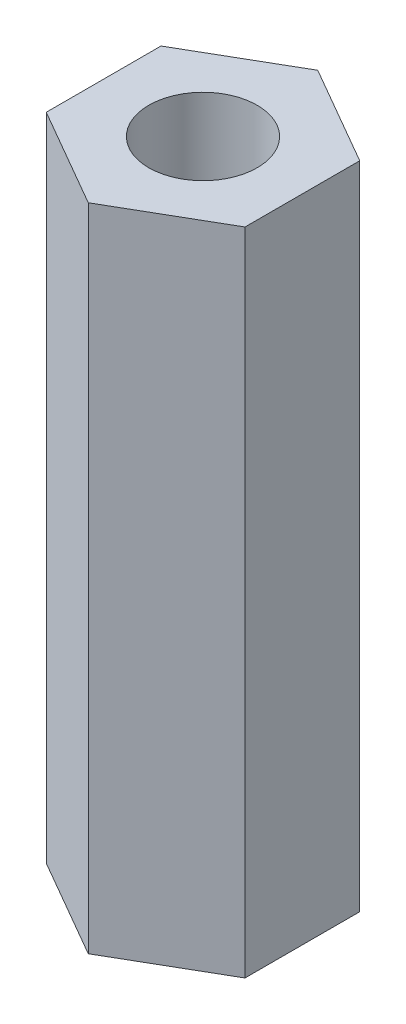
from build123d import *

# Parameters (mm, degrees)
SKETCH1_R           = 1.5
BOSS_EXTRUDE1_DEPTH = 18


with BuildPart() as part:
    # Sketch1 → Boss-Extrude1 (new body)
    with BuildSketch(Plane(origin=(0, 0, 0), x_dir=(1, 0, 0), z_dir=(0, 1, 0))):
        Polygon((2.75, 1.58771324), (0, 3.175426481), (-2.75, 1.58771324), (-2.75, -1.58771324), (0, -3.175426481), (2.75, -1.58771324), align=None)
        with Locations(Location((0, 0, 0), (0, 0, 270))):
            Circle(SKETCH1_R, mode=Mode.SUBTRACT)
    extrude(amount=BOSS_EXTRUDE1_DEPTH)


solid = part.part
